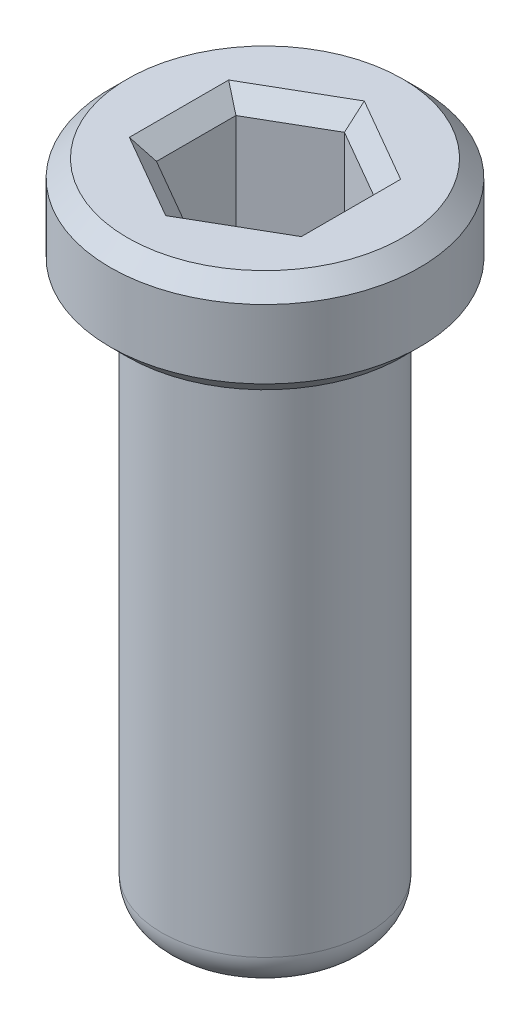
from build123d import *

# Parameters (mm, degrees)
SKETCH1_R           = 1.5
BOSS_EXTRUDE1_DEPTH = 8
SKETCH2_R           = 2.25
BOSS_EXTRUDE2_DEPTH = 1.5
CUT_EXTRUDE1_DEPTH  = 2
CHAMFER1_SIZE       = 0.25
FILLET1_R           = 0.5


with BuildPart() as part:
    # Sketch1 → Boss-Extrude1 (new body)
    with BuildSketch(Plane(origin=(0, 0, 0), x_dir=(1, 0, 0), z_dir=(0, 1, 0))):
        with Locations(Location((0, 0, 0), (0, 0, 270))):
            Circle(SKETCH1_R)
    extrude(amount=BOSS_EXTRUDE1_DEPTH)

    # Sketch2 → Boss-Extrude2 (add)
    with BuildSketch(Plane(origin=(0, 8, 0), x_dir=(1, 0, 0), z_dir=(0, 1, 0))):
        with Locations(Location((0, 0, 0), (0, 0, 270))):
            Circle(SKETCH2_R)
    extrude(amount=BOSS_EXTRUDE2_DEPTH)

    # Sketch3 → Cut-Extrude1 (cut)
    with BuildSketch(Plane(origin=(0, 9.5, 0), x_dir=(1, 0, 0), z_dir=(0, 1, 0))):
        Polygon((0, 1.154700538), (-1, 0.577350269), (-1, -0.577350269), (0, -1.154700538), (1, -0.577350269), (1, 0.577350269), align=None)
    extrude(amount=-CUT_EXTRUDE1_DEPTH, mode=Mode.SUBTRACT)

    # Chamfer1
    chamfer1_edges = [part.edges().sort_by_distance(p)[0] for p in [
        (0.5, 9.5, -0.866025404),
        (-0.5, 9.5, -0.866025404),
        (-1, 9.5, 0),
        (-0.5, 9.5, 0.866025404),
        (0.5, 9.5, 0.866025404),
        (1, 9.5, 0),
        (0, 8, -2.25),
        (0, 9.5, -2.25),
    ]]
    chamfer(chamfer1_edges, length=CHAMFER1_SIZE)

    # Fillet1
    fillet1_edges = [part.edges().sort_by_distance(p)[0] for p in [
        (0, 0, -1.5),
    ]]
    fillet(fillet1_edges, radius=FILLET1_R)


solid = part.part
